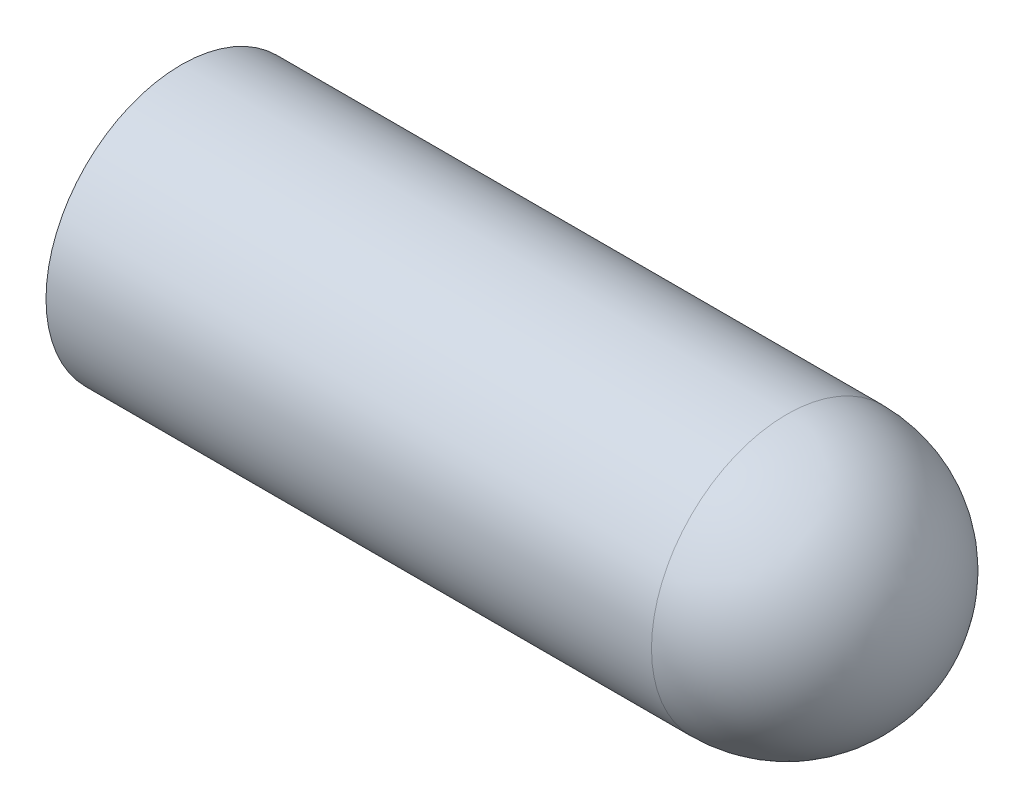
ISO-10303-21;
HEADER;
FILE_DESCRIPTION(('STEP AP214'),'2;1');
FILE_NAME('part.step','',(''),(''),'','','');
FILE_SCHEMA(('AUTOMOTIVE_DESIGN { 1 0 10303 214 1 1 1 1 }'));
ENDSEC;
DATA;
#1=APPLICATION_CONTEXT('core data for automotive mechanical design processes');
#2=APPLICATION_PROTOCOL_DEFINITION('international standard','automotive_design',2000,#1);
#3=PRODUCT_CONTEXT('',#1,'mechanical');
#4=PRODUCT('Part','Part','',(#3));
#5=PRODUCT_RELATED_PRODUCT_CATEGORY('part','',(#4));
#6=PRODUCT_DEFINITION_FORMATION('','',#4);
#7=PRODUCT_DEFINITION_CONTEXT('part definition',#1,'design');
#8=PRODUCT_DEFINITION('design','',#6,#7);
#9=PRODUCT_DEFINITION_SHAPE('','',#8);
#10=(LENGTH_UNIT() NAMED_UNIT(*) SI_UNIT(.MILLI.,.METRE.));
#11=(NAMED_UNIT(*) PLANE_ANGLE_UNIT() SI_UNIT($,.RADIAN.));
#12=(NAMED_UNIT(*) SI_UNIT($,.STERADIAN.) SOLID_ANGLE_UNIT());
#13=UNCERTAINTY_MEASURE_WITH_UNIT(LENGTH_MEASURE(1.E-05),#10,'distance_accuracy_value','');
#14=(GEOMETRIC_REPRESENTATION_CONTEXT(3) GLOBAL_UNCERTAINTY_ASSIGNED_CONTEXT((#13)) GLOBAL_UNIT_ASSIGNED_CONTEXT((#10,
#11,#12)) REPRESENTATION_CONTEXT('',''));
#15=CARTESIAN_POINT('',(0.,0.,0.));
#16=DIRECTION('',(0.,0.,1.));
#17=DIRECTION('',(1.,0.,0.));
#18=AXIS2_PLACEMENT_3D('',#15,#16,#17);
#19=CARTESIAN_POINT('',(-14.55,0.,0.));
#20=DIRECTION('',(-1.,0.,0.));
#21=DIRECTION('',(0.,-1.,0.));
#22=AXIS2_PLACEMENT_3D('',#19,#20,#21);
#23=PLANE('',#22);
#24=CARTESIAN_POINT('',(-14.55,0.,0.));
#25=DIRECTION('',(1.,0.,0.));
#26=DIRECTION('',(0.,1.,0.));
#27=AXIS2_PLACEMENT_3D('',#24,#25,#26);
#28=CIRCLE('',#27,6.5);
#29=CARTESIAN_POINT('',(-14.55,6.5,0.));
#30=VERTEX_POINT('',#29);
#31=EDGE_CURVE('E10',#30,#30,#28,.T.);
#32=ORIENTED_EDGE('',*,*,#31,.F.);
#33=EDGE_LOOP('',(#32));
#34=FACE_BOUND('',#33,.T.);
#35=CARTESIAN_POINT('',(-14.55,0.,0.));
#36=DIRECTION('',(-1.,0.,0.));
#37=DIRECTION('',(0.,-1.,0.));
#38=AXIS2_PLACEMENT_3D('',#35,#36,#37);
#39=CIRCLE('',#38,5.9);
#40=CARTESIAN_POINT('',(-14.55,-5.9,0.));
#41=VERTEX_POINT('',#40);
#42=EDGE_CURVE('E43',#41,#41,#39,.F.);
#43=ORIENTED_EDGE('',*,*,#42,.T.);
#44=EDGE_LOOP('',(#43));
#45=FACE_BOUND('',#44,.T.);
#46=ADVANCED_FACE('F32',(#34,#45),#23,.T.);
#47=CARTESIAN_POINT('',(14.55,0.,0.));
#48=DIRECTION('',(1.,0.,0.));
#49=DIRECTION('',(0.,1.,0.));
#50=AXIS2_PLACEMENT_3D('',#47,#48,#49);
#51=SPHERICAL_SURFACE('',#50,6.5);
#52=CARTESIAN_POINT('',(14.55,0.,0.));
#53=DIRECTION('',(1.,0.,0.));
#54=DIRECTION('',(0.,1.,0.));
#55=AXIS2_PLACEMENT_3D('',#52,#53,#54);
#56=CIRCLE('',#55,6.5);
#57=CARTESIAN_POINT('',(14.55,6.5,0.));
#58=VERTEX_POINT('',#57);
#59=EDGE_CURVE('E39',#58,#58,#56,.T.);
#60=ORIENTED_EDGE('',*,*,#59,.T.);
#61=EDGE_LOOP('',(#60));
#62=FACE_BOUND('',#61,.T.);
#63=ADVANCED_FACE('F34',(#62),#51,.T.);
#64=CARTESIAN_POINT('',(21.05,0.,0.));
#65=DIRECTION('',(1.,0.,0.));
#66=DIRECTION('',(0.,1.,0.));
#67=AXIS2_PLACEMENT_3D('',#64,#65,#66);
#68=CYLINDRICAL_SURFACE('',#67,6.5);
#69=ORIENTED_EDGE('',*,*,#31,.T.);
#70=EDGE_LOOP('',(#69));
#71=FACE_BOUND('',#70,.T.);
#72=ORIENTED_EDGE('',*,*,#59,.F.);
#73=EDGE_LOOP('',(#72));
#74=FACE_BOUND('',#73,.T.);
#75=ADVANCED_FACE('F57',(#71,#74),#68,.T.);
#76=CARTESIAN_POINT('',(14.55,0.,0.));
#77=DIRECTION('',(1.,0.,0.));
#78=DIRECTION('',(0.,1.,0.));
#79=AXIS2_PLACEMENT_3D('',#76,#77,#78);
#80=SPHERICAL_SURFACE('',#79,5.9);
#81=CARTESIAN_POINT('',(14.55,0.,0.));
#82=DIRECTION('',(1.,0.,0.));
#83=DIRECTION('',(0.,1.,0.));
#84=AXIS2_PLACEMENT_3D('',#81,#82,#83);
#85=CIRCLE('',#84,5.9);
#86=CARTESIAN_POINT('',(14.55,5.9,0.));
#87=VERTEX_POINT('',#86);
#88=EDGE_CURVE('E47',#87,#87,#85,.T.);
#89=ORIENTED_EDGE('',*,*,#88,.F.);
#90=EDGE_LOOP('',(#89));
#91=FACE_BOUND('',#90,.T.);
#92=ADVANCED_FACE('F55',(#91),#80,.F.);
#93=CARTESIAN_POINT('',(21.05,0.,0.));
#94=DIRECTION('',(1.,0.,0.));
#95=DIRECTION('',(0.,1.,0.));
#96=AXIS2_PLACEMENT_3D('',#93,#94,#95);
#97=CYLINDRICAL_SURFACE('',#96,5.9);
#98=ORIENTED_EDGE('',*,*,#42,.F.);
#99=EDGE_LOOP('',(#98));
#100=FACE_BOUND('',#99,.T.);
#101=ORIENTED_EDGE('',*,*,#88,.T.);
#102=EDGE_LOOP('',(#101));
#103=FACE_BOUND('',#102,.T.);
#104=ADVANCED_FACE('F53',(#100,#103),#97,.F.);
#105=CLOSED_SHELL('',(#46,#63,#75,#92,#104));
#106=MANIFOLD_SOLID_BREP('B2',#105);
#107=ADVANCED_BREP_SHAPE_REPRESENTATION('',(#18,#106),#14);
#108=SHAPE_DEFINITION_REPRESENTATION(#9,#107);
ENDSEC;
END-ISO-10303-21;
